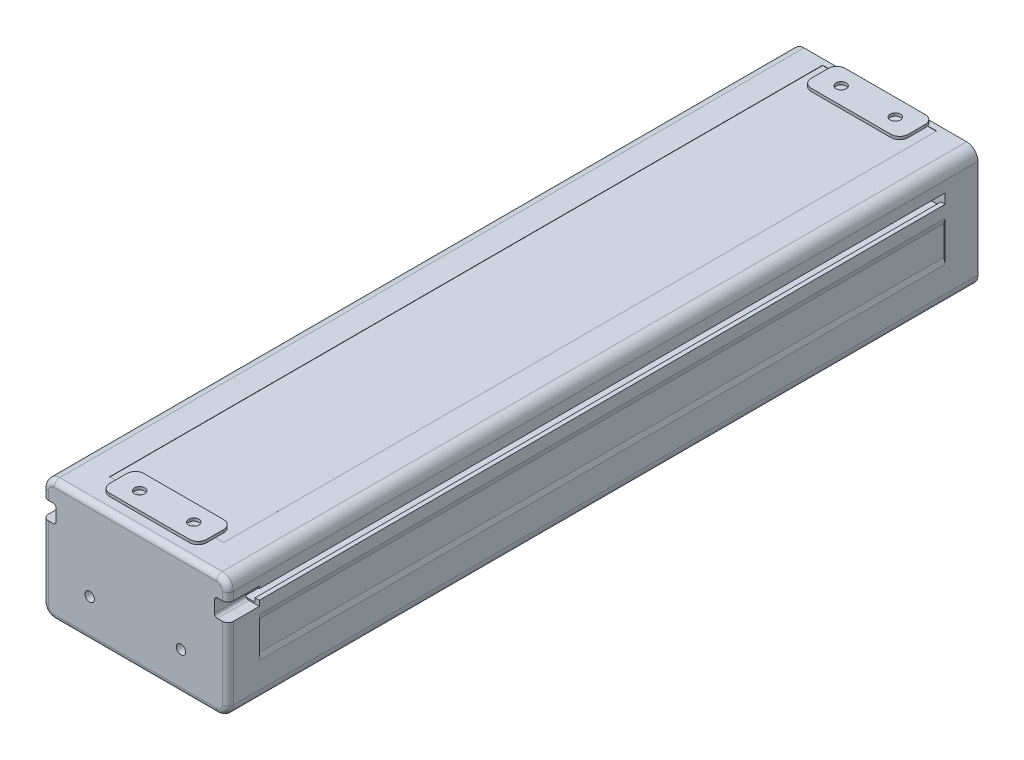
from build123d import *

# Parameters (mm, degrees)
EXTRUDE_1_DEPTH                     = 252
HOLE_WIZARD_M4_1_D                  = 4.4
HOLE_WIZARD_M4_1_CBORE_D            = 8
HOLE_WIZARD_M4_1_CBORE_DEPTH        = 4.2
PATTERN_LINEAR_1_COUNT              = 2
PATTERN_LINEAR_1_PITCH              = 23
PATTERN_LINEAR_2_COUNT              = 2
PATTERN_LINEAR_2_PITCH              = 11
PATTERN_LINEAR_2_COPY_1_D           = 4.4
PATTERN_LINEAR_2_COPY_1_CBORE_D     = 8
PATTERN_LINEAR_2_COPY_1_CBORE_DEPTH = 4.2
HOLE_WIZARD_M5_1_D                  = 4.2
PATTERN_LINEAR_4_COUNT              = 2
PATTERN_LINEAR_4_PITCH              = 23
PATTERN_LINEAR_5_COUNT              = 6
PATTERN_LINEAR_5_PITCH              = 40
PATTERN_LINEAR_5_COPY_1_D           = 4.2
PATTERN_LINEAR_5_COPY_2_D           = 4.2
PATTERN_LINEAR_5_COPY_3_D           = 4.2
PATTERN_LINEAR_5_COPY_4_D           = 4.2
PATTERN_LINEAR_5_COPY_5_D           = 4.2
HOLE_WIZARD_M4_2_D                  = 4.4
HOLE_WIZARD_M4_2_CBORE_D            = 8
HOLE_WIZARD_M4_2_CBORE_DEPTH        = 4.2
EXTRUDE_2_DEPTH                     = 240.5
EXTRUDE_6_DEPTH                     = 11
FILLET_1_R                          = 1
FILLET_2_R                          = 4
EXTRUDE_7_DEPTH                     = 11.5
CUT_EXTRUDE_1_DEPTH                 = 9
HOLE_WIZARD_M4_3_AT_2_COUNT         = 2
HOLE_WIZARD_M4_3_AT_2_PITCH         = 23
SKETCH_15_W                         = 34
SKETCH_15_H                         = 12
SKETCH_15_R                         = 1.8
EXTRUDE_8_DEPTH                     = 1
FILLET_3_R                          = 3
SKETCH_14_W                         = 40
SKETCH_14_H                         = 250
CUT_EXTRUDE_2_DEPTH                 = 0.1
FILLET_4_R                          = 2
HOLE_WIZARD_M4_1_2_D                = 3.3
HOLE_WIZARD_M4_1_2_DEPTH            = 14.1
HOLE_WIZARD_M4_1_2_TIP              = 0.991420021


with BuildPart() as part:
    # Sketch 1 → Extrude 1 (new body)
    with BuildSketch(Plane.XY):
        with BuildLine():
            Line((-20.85, 3.480384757), (-20.4, 3.740192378))
            ThreePointArc((-20.4, 3.740192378), (-20.290192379, 3.85), (-20.25, 4))
            Line((-20.25, 4), (-20.25, 5.134886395))
            ThreePointArc((-20.25, 5.134886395), (-19.030626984, 6.766047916), (-20.250994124, 8.396465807))
            Line((-20.250994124, 8.396465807), (-20.628312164, 9.05))
            ThreePointArc((-20.628312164, 9.05), (-20.628312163, 9.35), (-20.368504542, 9.5))
            Line((-20.368504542, 9.5), (20.368504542, 9.5))
            ThreePointArc((20.368504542, 9.5), (20.628312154, 9.350000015), (20.628312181, 9.050000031))
            Line((20.628312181, 9.050000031), (20.250994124, 8.396465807))
            ThreePointArc((20.250994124, 8.396465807), (19.030626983, 6.766047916), (20.25, 5.134886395))
            Line((20.25, 5.134886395), (20.25, 3.999999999))
            ThreePointArc((20.25, 3.999999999), (20.290192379, 3.85), (20.4, 3.740192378))
            Line((20.4, 3.740192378), (20.85, 3.480384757))
            ThreePointArc((20.85, 3.480384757), (20.959807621, 3.370577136), (21, 3.220577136))
            Line((21, 3.220577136), (21, 0.815685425))
            Line((21, 0.815685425), (20.184314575, 0))
            Line((20.184314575, 0), (9, 0))
            Line((9, 0), (8.5, 0.5))
            Line((8.5, 0.5), (-8.5, 0.5))
            Line((-8.5, 0.5), (-9, 0))
            Line((-9, 0), (-20.184314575, 0))
            Line((-20.184314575, 0), (-21, 0.815685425))
            Line((-21, 0.815685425), (-21, 3.220577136))
            ThreePointArc((-21, 3.220577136), (-20.959807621, 3.370577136), (-20.85, 3.480384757))
        make_face()
    extrude(amount=EXTRUDE_1_DEPTH)

    # Hole Wizard M4 _1 (through all)
    with Locations(Plane(origin=(-11.5, 0, 5), x_dir=(0, 0, -1), z_dir=(0, -1, 0))):
        with Locations((0, 0)):
            hole_wizard_m4_1 = CounterBoreHole(HOLE_WIZARD_M4_1_D / 2, HOLE_WIZARD_M4_1_CBORE_D / 2, HOLE_WIZARD_M4_1_CBORE_DEPTH)

    # Pattern Linear 1: Hole Wizard M4 _1 ×2
    with Locations(*[(i * PATTERN_LINEAR_1_PITCH, 0, 0) for i in range(1, PATTERN_LINEAR_1_COUNT)]):
        add(hole_wizard_m4_1, mode=Mode.SUBTRACT)

    # Pattern Linear 2: Hole Wizard M4 _1 ×2
    with Locations(*[(0, 0, i * PATTERN_LINEAR_2_PITCH) for i in range(1, PATTERN_LINEAR_2_COUNT)]):
        add(hole_wizard_m4_1, mode=Mode.SUBTRACT)

    # Pattern Linear 2 copy 1 (through all)
    with Locations(Plane(origin=(11.5, 0, 16), x_dir=(0, 0, -1), z_dir=(0, -1, 0))):
        with Locations((0, 0)):
            CounterBoreHole(PATTERN_LINEAR_2_COPY_1_D / 2, PATTERN_LINEAR_2_COPY_1_CBORE_D / 2, PATTERN_LINEAR_2_COPY_1_CBORE_DEPTH)

    # Hole Wizard M5 _1 (through all)
    with Locations(Plane(origin=(-11.5, 9.5, 27), x_dir=(0, 0, 1), z_dir=(0, 1, 0))):
        with Locations((0, 0)):
            hole_wizard_m5_1 = Hole(HOLE_WIZARD_M5_1_D / 2)

    # Pattern Linear 4: Hole Wizard M5 _1 ×2
    with Locations(*[(i * PATTERN_LINEAR_4_PITCH, 0, 0) for i in range(1, PATTERN_LINEAR_4_COUNT)]):
        add(hole_wizard_m5_1, mode=Mode.SUBTRACT)

    # Pattern Linear 5: Hole Wizard M5 _1 ×6
    with Locations(*[(0, 0, i * PATTERN_LINEAR_5_PITCH) for i in range(1, PATTERN_LINEAR_5_COUNT)]):
        add(hole_wizard_m5_1, mode=Mode.SUBTRACT)

    # Pattern Linear 5 copy 1 (through all)
    with Locations(Plane(origin=(11.5, 9.5, 67), x_dir=(0, 0, 1), z_dir=(0, 1, 0))):
        with Locations((0, 0)):
            Hole(PATTERN_LINEAR_5_COPY_1_D / 2)

    # Pattern Linear 5 copy 2 (through all)
    with Locations(Plane(origin=(11.5, 9.5, 107), x_dir=(0, 0, 1), z_dir=(0, 1, 0))):
        with Locations((0, 0)):
            Hole(PATTERN_LINEAR_5_COPY_2_D / 2)

    # Pattern Linear 5 copy 3 (through all)
    with Locations(Plane(origin=(11.5, 9.5, 147), x_dir=(0, 0, 1), z_dir=(0, 1, 0))):
        with Locations((0, 0)):
            Hole(PATTERN_LINEAR_5_COPY_3_D / 2)

    # Pattern Linear 5 copy 4 (through all)
    with Locations(Plane(origin=(11.5, 9.5, 187), x_dir=(0, 0, 1), z_dir=(0, 1, 0))):
        with Locations((0, 0)):
            Hole(PATTERN_LINEAR_5_COPY_4_D / 2)

    # Pattern Linear 5 copy 5 (through all)
    with Locations(Plane(origin=(11.5, 9.5, 227), x_dir=(0, 0, 1), z_dir=(0, 1, 0))):
        with Locations((0, 0)):
            Hole(PATTERN_LINEAR_5_COPY_5_D / 2)

    # Hole Wizard M4 _2 (through all)
    with Locations(Plane(origin=(-11.5, 0, 247), x_dir=(0, 0, -1), z_dir=(0, -1, 0))):
        with Locations((0, 0), (0, 23)):
            CounterBoreHole(HOLE_WIZARD_M4_2_D / 2, HOLE_WIZARD_M4_2_CBORE_D / 2, HOLE_WIZARD_M4_2_CBORE_DEPTH)

    # Sketch 10 → Extrude 6 (add)
    with BuildSketch(Plane.XY.offset(251)):
        Polygon((32.5, 43.9), (-32.5, 43.9), (-32.5, 37), (-27.8, 37), (-27.8, 30.8), (-32.5, 30.8), (-32.5, 1.4), (32.5, 1.4), (32.5, 30.8), (27.8, 30.8), (27.8, 37), (32.5, 37), align=None)
    extrude(amount=EXTRUDE_6_DEPTH)

    # Fillet 1
    fillet_1_edges = [part.edges().sort_by_distance(p)[0] for p in [
        (-27.8, 37, 256.5),
        (-27.8, 30.8, 256.5),
        (27.8, 30.8, 256.5),
        (27.8, 37, 256.5),
    ]]
    fillet(fillet_1_edges, radius=FILLET_1_R)

    # Fillet 2
    fillet_2_edges = [part.edges().sort_by_distance(p)[0] for p in [
        (-32.5, 1.4, 256.5),
        (-32.5, 43.9, 256.5),
        (32.5, 1.4, 256.5),
        (32.5, 43.9, 256.5),
    ]]
    fillet(fillet_2_edges, radius=FILLET_2_R)

    # Sketch 11 → Extrude 7 (add)
    with BuildSketch(Plane(origin=(0, 0, 10.5), x_dir=(-1, 0, 0), z_dir=(0, 0, -1))):
        with BuildLine():
            Line((-28.5, 43.9), (28.5, 43.9))
            ThreePointArc((28.5, 43.9), (31.328427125, 42.728427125), (32.5, 39.9))
            Line((32.5, 39.9), (32.5, 5.4))
            ThreePointArc((32.5, 5.4), (31.328427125, 2.571572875), (28.5, 1.4))
            Line((28.5, 1.4), (-28.5, 1.4))
            ThreePointArc((-28.5, 1.4), (-31.328427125, 2.571572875), (-32.5, 5.4))
            Line((-32.5, 5.4), (-32.5, 39.9))
            ThreePointArc((-32.5, 39.9), (-31.328427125, 42.728427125), (-28.5, 43.9))
        make_face()
    extrude(amount=EXTRUDE_7_DEPTH)

    # Sketch 12 → Cut-Extrude 1 (cut)
    with BuildSketch(Plane.XZ.offset(-0.5)):
        with BuildLine():
            Line((-21, 0), (21, 0))
            Line((21, 0), (21, -3))
            ThreePointArc((21, -3), (19.828427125, -5.828427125), (17, -7))
            Line((17, -7), (-17, -7))
            ThreePointArc((-17, -7), (-19.828427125, -5.828427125), (-21, -3))
            Line((-21, -3), (-21, 0))
        make_face()
        with BuildLine():
            Line((21, 252), (-21, 252))
            Line((-21, 252), (-21, 253))
            ThreePointArc((-21, 253), (-19.828427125, 255.828427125), (-17, 257))
            Line((-17, 257), (17, 257))
            ThreePointArc((17, 257), (19.828427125, 255.828427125), (21, 253))
            Line((21, 253), (21, 252))
        make_face()
    extrude(amount=-CUT_EXTRUDE_1_DEPTH, mode=Mode.SUBTRACT)

    # Sketch 20 → Hole Wizard M4 _3 (revolve, cut)
    with BuildSketch(Plane(origin=(-11.5, 0, 5), x_dir=(0, 0, -1), z_dir=(1, 0, 0))):
        Polygon((0, 0), (0, 8), (2.2, 8), (2.2, 5), (2.1, 5), (2.1, 0), align=None)
    hole_wizard_m4_3 = revolve(axis=Axis((-11.5, -6.35, 5), (0, 1, 0)), mode=Mode.SUBTRACT)

    # Hole Wizard M4 _3 at 2: Hole Wizard M4 _3 ×2
    with Locations(*[(i * HOLE_WIZARD_M4_3_AT_2_PITCH, 0, 0) for i in range(1, HOLE_WIZARD_M4_3_AT_2_COUNT)]):
        add(hole_wizard_m4_3, mode=Mode.SUBTRACT)



with BuildPart() as body_2:
    # Sketch 9 → Extrude 2 (new body)
    with BuildSketch(Plane.XY.offset(251)):
        with BuildLine():
            Line((-32, 26.5), (-32, 16.3))
            Line((-32, 16.3), (-32.5, 14.4))
            Line((-32.5, 14.4), (-32.5, 5.4))
            ThreePointArc((-32.5, 5.4), (-31.328427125, 2.571572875), (-28.5, 1.4))
            Line((-28.5, 1.4), (-18.5, 1.4))
            Line((-18.5, 1.4), (-18.5, 9.5))
            Line((-18.5, 9.5), (18.5, 9.5))
            Line((18.5, 9.5), (18.5, 1.4))
            Line((18.5, 1.4), (28.5, 1.4))
            ThreePointArc((28.5, 1.4), (31.328427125, 2.571572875), (32.5, 5.4))
            Line((32.5, 5.4), (32.5, 14.4))
            Line((32.5, 14.4), (32, 16.3))
            Line((32, 16.3), (32, 26.5))
            Line((32, 26.5), (32.5, 28.4))
            Line((32.5, 28.4), (32.5, 32.65))
            Line((32.5, 32.65), (31, 32.65))
            Line((31, 32.65), (31, 31.3))
            Line((31, 31.3), (27.3, 31.3))
            Line((27.3, 31.3), (27.3, 37.5))
            Line((27.3, 37.5), (31, 37.5))
            Line((31, 37.5), (31, 36.15))
            Line((31, 36.15), (32.5, 36.15))
            Line((32.5, 36.15), (32.5, 39.9))
            ThreePointArc((32.5, 39.9), (31.328427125, 42.728427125), (28.5, 43.9))
            Line((28.5, 43.9), (0, 43.9))
            Line((0, 43.9), (-28.5, 43.9))
            ThreePointArc((-28.5, 43.9), (-31.328427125, 42.728427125), (-32.5, 39.9))
            Line((-32.5, 39.9), (-32.5, 36.15))
            Line((-32.5, 36.15), (-31, 36.15))
            Line((-31, 36.15), (-31, 37.5))
            Line((-31, 37.5), (-27.3, 37.5))
            Line((-27.3, 37.5), (-27.3, 31.3))
            Line((-27.3, 31.3), (-31, 31.3))
            Line((-31, 31.3), (-31, 32.65))
            Line((-31, 32.65), (-32.5, 32.65))
            Line((-32.5, 32.65), (-32.5, 28.4))
            Line((-32.5, 28.4), (-32, 26.5))
        make_face()
    extrude(amount=-EXTRUDE_2_DEPTH)


with BuildPart() as part_1:
    add(part.part)

    add(body_2.part)  # Extrude 8 merges body 2
    # Sketch 15 → Extrude 8 (add)
    # profile 1 of 2: a face of its own
    with BuildSketch(Plane(origin=(0, 43.9, 0), x_dir=(1, 0, 0), z_dir=(0, 1, 0))):
        with Locations((0, -5)):
            Rectangle(SKETCH_15_W, SKETCH_15_H)
        with Locations(Location((-9.5, -5, 0), (0, 0, 270))):
            Circle(SKETCH_15_R, mode=Mode.SUBTRACT)
        with Locations(Location((9.5, -5, 0), (0, 0, 90))):
            Circle(SKETCH_15_R, mode=Mode.SUBTRACT)
    # profile 2 of 2: a face of its own
    with BuildSketch(Plane(origin=(0, 43.9, 0), x_dir=(1, 0, 0), z_dir=(0, 1, 0))):
        with Locations((0, -251)):
            Rectangle(SKETCH_15_W, SKETCH_15_H)
        with Locations(Location((-9.5, -251, 0), (0, 0, 270))):
            Circle(SKETCH_15_R, mode=Mode.SUBTRACT)
        with Locations(Location((9.5, -251, 0), (0, 0, 90))):
            Circle(SKETCH_15_R, mode=Mode.SUBTRACT)
    extrude(amount=EXTRUDE_8_DEPTH)

    # Fillet 3
    fillet_3_edges = [part_1.edges().sort_by_distance(p)[0] for p in [
        (-17, 44.4, -1),
        (-17, 44.4, 11),
        (17, 44.4, 11),
        (17, 44.4, -1),
        (-17, 44.4, 245),
        (-17, 44.4, 257),
        (17, 44.4, 257),
        (17, 44.4, 245),
    ]]
    fillet(fillet_3_edges, radius=FILLET_3_R)

    # Sketch 14 → Cut-Extrude 2 (cut)
    with BuildSketch(Plane(origin=(0, 43.9, 0), x_dir=(1, 0, 0), z_dir=(0, 1, 0))):
        with Locations((0, -126)):
            Rectangle(SKETCH_14_W, SKETCH_14_H)
    extrude(amount=-CUT_EXTRUDE_2_DEPTH, mode=Mode.SUBTRACT)

    # Fillet 4
    fillet_4_edges = [part_1.edges().sort_by_distance(p)[0] for p in [
        (-32.5, 18.1, 262),
        (-31.328427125, 2.571572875, 262),
        (0, 1.4, 262),
        (31.328427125, 2.571572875, 262),
        (32.5, 18.1, 262),
        (32.5, 38.45, 262),
        (31.328427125, 42.728427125, 262),
        (0, 43.9, 262),
        (-31.328427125, 42.728427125, 262),
        (-32.5, 38.45, 262),
    ]]
    fillet(fillet_4_edges, radius=FILLET_4_R)

    # Hole Wizard M4 _1 2
    with Locations(Plane.XY.offset(262)):
        with Locations((-16, 15), (16, 15)):
            Hole(HOLE_WIZARD_M4_1_2_D / 2, depth=HOLE_WIZARD_M4_1_2_DEPTH)
            with Locations((0, 0, -(HOLE_WIZARD_M4_1_2_DEPTH + HOLE_WIZARD_M4_1_2_TIP / 2))):  # 118° drill point
                Cone(0, HOLE_WIZARD_M4_1_2_D / 2, HOLE_WIZARD_M4_1_2_TIP, mode=Mode.SUBTRACT)


solid = part_1.part
